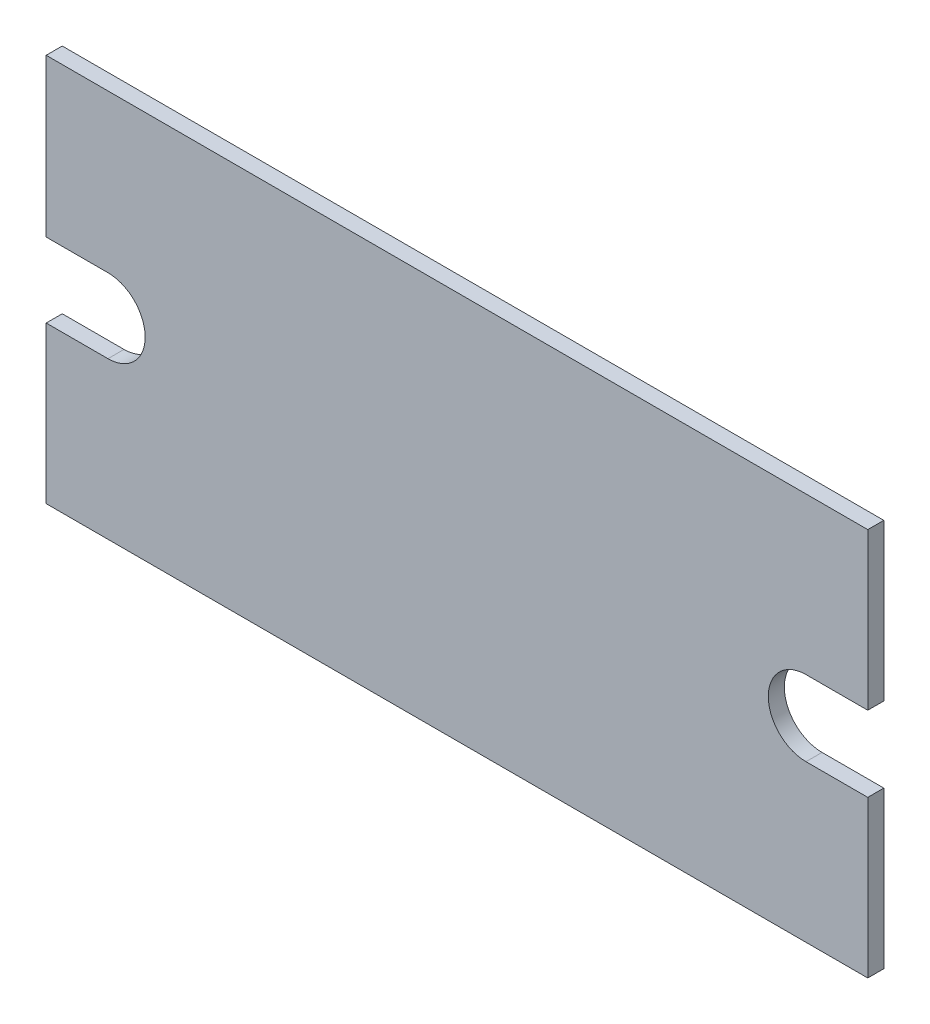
ISO-10303-21;
HEADER;
FILE_DESCRIPTION(('STEP AP214'),'2;1');
FILE_NAME('part.step','',(''),(''),'','','');
FILE_SCHEMA(('AUTOMOTIVE_DESIGN { 1 0 10303 214 1 1 1 1 }'));
ENDSEC;
DATA;
#1=APPLICATION_CONTEXT('core data for automotive mechanical design processes');
#2=APPLICATION_PROTOCOL_DEFINITION('international standard','automotive_design',2000,#1);
#3=PRODUCT_CONTEXT('',#1,'mechanical');
#4=PRODUCT('Part','Part','',(#3));
#5=PRODUCT_RELATED_PRODUCT_CATEGORY('part','',(#4));
#6=PRODUCT_DEFINITION_FORMATION('','',#4);
#7=PRODUCT_DEFINITION_CONTEXT('part definition',#1,'design');
#8=PRODUCT_DEFINITION('design','',#6,#7);
#9=PRODUCT_DEFINITION_SHAPE('','',#8);
#10=(LENGTH_UNIT() NAMED_UNIT(*) SI_UNIT(.MILLI.,.METRE.));
#11=(NAMED_UNIT(*) PLANE_ANGLE_UNIT() SI_UNIT($,.RADIAN.));
#12=(NAMED_UNIT(*) SI_UNIT($,.STERADIAN.) SOLID_ANGLE_UNIT());
#13=UNCERTAINTY_MEASURE_WITH_UNIT(LENGTH_MEASURE(1.E-05),#10,'distance_accuracy_value','');
#14=(GEOMETRIC_REPRESENTATION_CONTEXT(3) GLOBAL_UNCERTAINTY_ASSIGNED_CONTEXT((#13)) GLOBAL_UNIT_ASSIGNED_CONTEXT((#10,
#11,#12)) REPRESENTATION_CONTEXT('',''));
#15=CARTESIAN_POINT('',(0.,0.,0.));
#16=DIRECTION('',(0.,0.,1.));
#17=DIRECTION('',(1.,0.,0.));
#18=AXIS2_PLACEMENT_3D('',#15,#16,#17);
#19=CARTESIAN_POINT('',(-27.267227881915,0.335772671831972,1.));
#20=DIRECTION('',(1.,0.,0.));
#21=DIRECTION('',(0.,1.,0.));
#22=AXIS2_PLACEMENT_3D('',#19,#20,#21);
#23=PLANE('',#22);
#24=DIRECTION('',(0.,-1.,0.));
#25=VECTOR('',#24,1.);
#26=CARTESIAN_POINT('',(-27.267227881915,0.335772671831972,0.));
#27=LINE('',#26,#25);
#28=CARTESIAN_POINT('',(-27.267227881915,10.1470554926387,0.));
#29=VERTEX_POINT('',#28);
#30=CARTESIAN_POINT('',(-27.267227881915,0.335772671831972,0.));
#31=VERTEX_POINT('',#30);
#32=EDGE_CURVE('E160',#29,#31,#27,.T.);
#33=ORIENTED_EDGE('',*,*,#32,.T.);
#34=DIRECTION('',(0.,0.,-1.));
#35=VECTOR('',#34,1.);
#36=CARTESIAN_POINT('',(-27.267227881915,0.335772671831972,1.));
#37=LINE('',#36,#35);
#38=CARTESIAN_POINT('',(-27.267227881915,0.335772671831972,1.));
#39=VERTEX_POINT('',#38);
#40=EDGE_CURVE('E44',#39,#31,#37,.T.);
#41=ORIENTED_EDGE('',*,*,#40,.F.);
#42=DIRECTION('',(0.,-1.,0.));
#43=VECTOR('',#42,1.);
#44=CARTESIAN_POINT('',(-27.267227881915,10.085772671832,1.));
#45=LINE('',#44,#43);
#46=CARTESIAN_POINT('',(-27.267227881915,10.1470554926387,1.));
#47=VERTEX_POINT('',#46);
#48=EDGE_CURVE('E108',#47,#39,#45,.T.);
#49=ORIENTED_EDGE('',*,*,#48,.F.);
#50=DIRECTION('',(0.,0.,-1.));
#51=VECTOR('',#50,1.);
#52=CARTESIAN_POINT('',(-27.267227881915,10.1470554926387,1.));
#53=LINE('',#52,#51);
#54=EDGE_CURVE('E11',#47,#29,#53,.T.);
#55=ORIENTED_EDGE('',*,*,#54,.T.);
#56=EDGE_LOOP('',(#33,#41,#49,#55));
#57=FACE_BOUND('',#56,.T.);
#58=ADVANCED_FACE('F36',(#57),#23,.F.);
#59=CARTESIAN_POINT('',(-27.267227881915,0.335772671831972,1.));
#60=DIRECTION('',(0.,1.,0.));
#61=DIRECTION('',(0.,0.,1.));
#62=AXIS2_PLACEMENT_3D('',#59,#60,#61);
#63=PLANE('',#62);
#64=DIRECTION('',(1.,0.,0.));
#65=VECTOR('',#64,1.);
#66=CARTESIAN_POINT('',(-27.267227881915,0.335772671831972,0.));
#67=LINE('',#66,#65);
#68=CARTESIAN_POINT('',(-23.417227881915,0.335772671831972,0.));
#69=VERTEX_POINT('',#68);
#70=EDGE_CURVE('E162',#31,#69,#67,.T.);
#71=ORIENTED_EDGE('',*,*,#70,.T.);
#72=DIRECTION('',(0.,0.,-1.));
#73=VECTOR('',#72,1.);
#74=CARTESIAN_POINT('',(-23.417227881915,0.335772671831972,1.));
#75=LINE('',#74,#73);
#76=CARTESIAN_POINT('',(-23.417227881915,0.335772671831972,1.));
#77=VERTEX_POINT('',#76);
#78=EDGE_CURVE('E200',#77,#69,#75,.T.);
#79=ORIENTED_EDGE('',*,*,#78,.F.);
#80=DIRECTION('',(1.,0.,0.));
#81=VECTOR('',#80,1.);
#82=CARTESIAN_POINT('',(-27.267227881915,0.335772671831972,1.));
#83=LINE('',#82,#81);
#84=EDGE_CURVE('E208',#39,#77,#83,.T.);
#85=ORIENTED_EDGE('',*,*,#84,.F.);
#86=ORIENTED_EDGE('',*,*,#40,.T.);
#87=EDGE_LOOP('',(#71,#79,#85,#86));
#88=FACE_BOUND('',#87,.T.);
#89=ADVANCED_FACE('F206',(#88),#63,.F.);
#90=CARTESIAN_POINT('',(-23.417227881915,-1.98358591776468,1.));
#91=DIRECTION('',(0.,0.,-1.));
#92=DIRECTION('',(-1.,0.,0.));
#93=AXIS2_PLACEMENT_3D('',#90,#91,#92);
#94=CYLINDRICAL_SURFACE('',#93,2.31935858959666);
#95=CARTESIAN_POINT('',(-23.417227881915,-1.98358591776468,0.));
#96=DIRECTION('',(0.,0.,-1.));
#97=DIRECTION('',(-1.,0.,0.));
#98=AXIS2_PLACEMENT_3D('',#95,#96,#97);
#99=CIRCLE('',#98,2.31935858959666);
#100=CARTESIAN_POINT('',(-23.417227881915,-4.30294450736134,0.));
#101=VERTEX_POINT('',#100);
#102=EDGE_CURVE('E164',#69,#101,#99,.T.);
#103=ORIENTED_EDGE('',*,*,#102,.T.);
#104=DIRECTION('',(0.,0.,-1.));
#105=VECTOR('',#104,1.);
#106=CARTESIAN_POINT('',(-23.417227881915,-4.30294450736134,1.));
#107=LINE('',#106,#105);
#108=CARTESIAN_POINT('',(-23.417227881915,-4.30294450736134,1.));
#109=VERTEX_POINT('',#108);
#110=EDGE_CURVE('E197',#109,#101,#107,.T.);
#111=ORIENTED_EDGE('',*,*,#110,.F.);
#112=CARTESIAN_POINT('',(-23.417227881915,-1.98358591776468,1.));
#113=DIRECTION('',(0.,0.,-1.));
#114=DIRECTION('',(-1.,0.,0.));
#115=AXIS2_PLACEMENT_3D('',#112,#113,#114);
#116=CIRCLE('',#115,2.31935858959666);
#117=EDGE_CURVE('E226',#77,#109,#116,.T.);
#118=ORIENTED_EDGE('',*,*,#117,.F.);
#119=ORIENTED_EDGE('',*,*,#78,.T.);
#120=EDGE_LOOP('',(#103,#111,#118,#119));
#121=FACE_BOUND('',#120,.T.);
#122=ADVANCED_FACE('F217',(#121),#94,.F.);
#123=CARTESIAN_POINT('',(-27.267227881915,-4.30294450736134,1.));
#124=DIRECTION('',(0.,-1.,0.));
#125=DIRECTION('',(1.,0.,0.));
#126=AXIS2_PLACEMENT_3D('',#123,#124,#125);
#127=PLANE('',#126);
#128=DIRECTION('',(-1.,0.,0.));
#129=VECTOR('',#128,1.);
#130=CARTESIAN_POINT('',(-27.267227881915,-4.30294450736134,0.));
#131=LINE('',#130,#129);
#132=CARTESIAN_POINT('',(-27.267227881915,-4.30294450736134,0.));
#133=VERTEX_POINT('',#132);
#134=EDGE_CURVE('E166',#101,#133,#131,.T.);
#135=ORIENTED_EDGE('',*,*,#134,.T.);
#136=DIRECTION('',(0.,0.,-1.));
#137=VECTOR('',#136,1.);
#138=CARTESIAN_POINT('',(-27.267227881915,-4.30294450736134,1.));
#139=LINE('',#138,#137);
#140=CARTESIAN_POINT('',(-27.267227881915,-4.30294450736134,1.));
#141=VERTEX_POINT('',#140);
#142=EDGE_CURVE('E194',#141,#133,#139,.T.);
#143=ORIENTED_EDGE('',*,*,#142,.F.);
#144=DIRECTION('',(-1.,0.,0.));
#145=VECTOR('',#144,1.);
#146=CARTESIAN_POINT('',(-27.267227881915,-4.30294450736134,1.));
#147=LINE('',#146,#145);
#148=EDGE_CURVE('E223',#109,#141,#147,.T.);
#149=ORIENTED_EDGE('',*,*,#148,.F.);
#150=ORIENTED_EDGE('',*,*,#110,.T.);
#151=EDGE_LOOP('',(#135,#143,#149,#150));
#152=FACE_BOUND('',#151,.T.);
#153=ADVANCED_FACE('F221',(#152),#127,.F.);
#154=CARTESIAN_POINT('',(-27.267227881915,-14.0529445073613,1.));
#155=DIRECTION('',(1.,0.,0.));
#156=DIRECTION('',(0.,0.,-1.));
#157=AXIS2_PLACEMENT_3D('',#154,#155,#156);
#158=PLANE('',#157);
#159=DIRECTION('',(0.,-1.,0.));
#160=VECTOR('',#159,1.);
#161=CARTESIAN_POINT('',(-27.267227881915,-14.0529445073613,0.));
#162=LINE('',#161,#160);
#163=CARTESIAN_POINT('',(-27.267227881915,-14.0529445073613,0.));
#164=VERTEX_POINT('',#163);
#165=EDGE_CURVE('E168',#133,#164,#162,.T.);
#166=ORIENTED_EDGE('',*,*,#165,.T.);
#167=DIRECTION('',(0.,0.,-1.));
#168=VECTOR('',#167,1.);
#169=CARTESIAN_POINT('',(-27.267227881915,-14.0529445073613,1.));
#170=LINE('',#169,#168);
#171=CARTESIAN_POINT('',(-27.267227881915,-14.0529445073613,1.));
#172=VERTEX_POINT('',#171);
#173=EDGE_CURVE('E191',#172,#164,#170,.T.);
#174=ORIENTED_EDGE('',*,*,#173,.F.);
#175=DIRECTION('',(0.,-1.,0.));
#176=VECTOR('',#175,1.);
#177=CARTESIAN_POINT('',(-27.267227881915,-14.0529445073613,1.));
#178=LINE('',#177,#176);
#179=EDGE_CURVE('E225',#141,#172,#178,.T.);
#180=ORIENTED_EDGE('',*,*,#179,.F.);
#181=ORIENTED_EDGE('',*,*,#142,.T.);
#182=EDGE_LOOP('',(#166,#174,#180,#181));
#183=FACE_BOUND('',#182,.T.);
#184=ADVANCED_FACE('F257',(#183),#158,.F.);
#185=CARTESIAN_POINT('',(23.932772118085,-14.0529445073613,1.));
#186=DIRECTION('',(0.,1.,0.));
#187=DIRECTION('',(-1.,0.,0.));
#188=AXIS2_PLACEMENT_3D('',#185,#186,#187);
#189=PLANE('',#188);
#190=DIRECTION('',(1.,0.,0.));
#191=VECTOR('',#190,1.);
#192=CARTESIAN_POINT('',(23.932772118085,-14.0529445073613,0.));
#193=LINE('',#192,#191);
#194=CARTESIAN_POINT('',(23.932772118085,-14.0529445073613,0.));
#195=VERTEX_POINT('',#194);
#196=EDGE_CURVE('E170',#164,#195,#193,.T.);
#197=ORIENTED_EDGE('',*,*,#196,.T.);
#198=DIRECTION('',(0.,0.,-1.));
#199=VECTOR('',#198,1.);
#200=CARTESIAN_POINT('',(23.932772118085,-14.0529445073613,1.));
#201=LINE('',#200,#199);
#202=CARTESIAN_POINT('',(23.932772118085,-14.0529445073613,1.));
#203=VERTEX_POINT('',#202);
#204=EDGE_CURVE('E188',#203,#195,#201,.T.);
#205=ORIENTED_EDGE('',*,*,#204,.F.);
#206=DIRECTION('',(1.,0.,0.));
#207=VECTOR('',#206,1.);
#208=CARTESIAN_POINT('',(23.932772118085,-14.0529445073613,1.));
#209=LINE('',#208,#207);
#210=EDGE_CURVE('E228',#172,#203,#209,.T.);
#211=ORIENTED_EDGE('',*,*,#210,.F.);
#212=ORIENTED_EDGE('',*,*,#173,.T.);
#213=EDGE_LOOP('',(#197,#205,#211,#212));
#214=FACE_BOUND('',#213,.T.);
#215=ADVANCED_FACE('F260',(#214),#189,.F.);
#216=CARTESIAN_POINT('',(23.932772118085,-4.30294450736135,1.));
#217=DIRECTION('',(-1.,0.,0.));
#218=DIRECTION('',(0.,-1.,0.));
#219=AXIS2_PLACEMENT_3D('',#216,#217,#218);
#220=PLANE('',#219);
#221=DIRECTION('',(0.,1.,0.));
#222=VECTOR('',#221,1.);
#223=CARTESIAN_POINT('',(23.932772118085,-4.30294450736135,0.));
#224=LINE('',#223,#222);
#225=CARTESIAN_POINT('',(23.932772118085,-4.30294450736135,0.));
#226=VERTEX_POINT('',#225);
#227=EDGE_CURVE('E172',#195,#226,#224,.T.);
#228=ORIENTED_EDGE('',*,*,#227,.T.);
#229=DIRECTION('',(0.,0.,-1.));
#230=VECTOR('',#229,1.);
#231=CARTESIAN_POINT('',(23.932772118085,-4.30294450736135,1.));
#232=LINE('',#231,#230);
#233=CARTESIAN_POINT('',(23.932772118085,-4.30294450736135,1.));
#234=VERTEX_POINT('',#233);
#235=EDGE_CURVE('E185',#234,#226,#232,.T.);
#236=ORIENTED_EDGE('',*,*,#235,.F.);
#237=DIRECTION('',(0.,1.,0.));
#238=VECTOR('',#237,1.);
#239=CARTESIAN_POINT('',(23.932772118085,-4.30294450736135,1.));
#240=LINE('',#239,#238);
#241=EDGE_CURVE('E234',#203,#234,#240,.T.);
#242=ORIENTED_EDGE('',*,*,#241,.F.);
#243=ORIENTED_EDGE('',*,*,#204,.T.);
#244=EDGE_LOOP('',(#228,#236,#242,#243));
#245=FACE_BOUND('',#244,.T.);
#246=ADVANCED_FACE('F240',(#245),#220,.F.);
#247=CARTESIAN_POINT('',(23.932772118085,-4.30294450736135,1.));
#248=DIRECTION('',(0.,-1.,0.));
#249=DIRECTION('',(1.,0.,0.));
#250=AXIS2_PLACEMENT_3D('',#247,#248,#249);
#251=PLANE('',#250);
#252=DIRECTION('',(-1.,0.,0.));
#253=VECTOR('',#252,1.);
#254=CARTESIAN_POINT('',(23.932772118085,-4.30294450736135,0.));
#255=LINE('',#254,#253);
#256=CARTESIAN_POINT('',(20.082772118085,-4.30294450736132,0.));
#257=VERTEX_POINT('',#256);
#258=EDGE_CURVE('E174',#226,#257,#255,.T.);
#259=ORIENTED_EDGE('',*,*,#258,.T.);
#260=DIRECTION('',(0.,0.,-1.));
#261=VECTOR('',#260,1.);
#262=CARTESIAN_POINT('',(20.082772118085,-4.30294450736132,1.));
#263=LINE('',#262,#261);
#264=CARTESIAN_POINT('',(20.082772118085,-4.30294450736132,1.));
#265=VERTEX_POINT('',#264);
#266=EDGE_CURVE('E149',#265,#257,#263,.T.);
#267=ORIENTED_EDGE('',*,*,#266,.F.);
#268=DIRECTION('',(-1.,0.,0.));
#269=VECTOR('',#268,1.);
#270=CARTESIAN_POINT('',(23.932772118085,-4.30294450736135,1.));
#271=LINE('',#270,#269);
#272=EDGE_CURVE('E140',#234,#265,#271,.T.);
#273=ORIENTED_EDGE('',*,*,#272,.F.);
#274=ORIENTED_EDGE('',*,*,#235,.T.);
#275=EDGE_LOOP('',(#259,#267,#273,#274));
#276=FACE_BOUND('',#275,.T.);
#277=ADVANCED_FACE('F244',(#276),#251,.F.);
#278=CARTESIAN_POINT('',(20.082772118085,-1.95294450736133,1.));
#279=DIRECTION('',(0.,0.,-1.));
#280=DIRECTION('',(-1.,0.,0.));
#281=AXIS2_PLACEMENT_3D('',#278,#279,#280);
#282=CYLINDRICAL_SURFACE('',#281,2.34999999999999);
#283=CARTESIAN_POINT('',(20.082772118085,-1.95294450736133,0.));
#284=DIRECTION('',(0.,0.,-1.));
#285=DIRECTION('',(1.,0.,0.));
#286=AXIS2_PLACEMENT_3D('',#283,#284,#285);
#287=CIRCLE('',#286,2.34999999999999);
#288=CARTESIAN_POINT('',(20.082772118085,0.397055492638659,0.));
#289=VERTEX_POINT('',#288);
#290=EDGE_CURVE('E148',#257,#289,#287,.T.);
#291=ORIENTED_EDGE('',*,*,#290,.T.);
#292=DIRECTION('',(0.,0.,-1.));
#293=VECTOR('',#292,1.);
#294=CARTESIAN_POINT('',(20.082772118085,0.397055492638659,1.));
#295=LINE('',#294,#293);
#296=CARTESIAN_POINT('',(20.082772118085,0.397055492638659,1.));
#297=VERTEX_POINT('',#296);
#298=EDGE_CURVE('E145',#297,#289,#295,.T.);
#299=ORIENTED_EDGE('',*,*,#298,.F.);
#300=CARTESIAN_POINT('',(20.082772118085,-1.95294450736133,1.));
#301=DIRECTION('',(0.,0.,-1.));
#302=DIRECTION('',(1.,0.,0.));
#303=AXIS2_PLACEMENT_3D('',#300,#301,#302);
#304=CIRCLE('',#303,2.34999999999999);
#305=EDGE_CURVE('E134',#265,#297,#304,.T.);
#306=ORIENTED_EDGE('',*,*,#305,.F.);
#307=ORIENTED_EDGE('',*,*,#266,.T.);
#308=EDGE_LOOP('',(#291,#299,#306,#307));
#309=FACE_BOUND('',#308,.T.);
#310=ADVANCED_FACE('F146',(#309),#282,.F.);
#311=CARTESIAN_POINT('',(23.932772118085,0.397055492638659,1.));
#312=DIRECTION('',(0.,1.,0.));
#313=DIRECTION('',(-1.,0.,0.));
#314=AXIS2_PLACEMENT_3D('',#311,#312,#313);
#315=PLANE('',#314);
#316=DIRECTION('',(1.,0.,0.));
#317=VECTOR('',#316,1.);
#318=CARTESIAN_POINT('',(23.932772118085,0.397055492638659,0.));
#319=LINE('',#318,#317);
#320=CARTESIAN_POINT('',(23.932772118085,0.397055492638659,0.));
#321=VERTEX_POINT('',#320);
#322=EDGE_CURVE('E94',#289,#321,#319,.T.);
#323=ORIENTED_EDGE('',*,*,#322,.T.);
#324=DIRECTION('',(0.,0.,-1.));
#325=VECTOR('',#324,1.);
#326=CARTESIAN_POINT('',(23.932772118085,0.397055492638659,1.));
#327=LINE('',#326,#325);
#328=CARTESIAN_POINT('',(23.932772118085,0.397055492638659,1.));
#329=VERTEX_POINT('',#328);
#330=EDGE_CURVE('E150',#329,#321,#327,.T.);
#331=ORIENTED_EDGE('',*,*,#330,.F.);
#332=DIRECTION('',(1.,0.,0.));
#333=VECTOR('',#332,1.);
#334=CARTESIAN_POINT('',(23.932772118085,0.397055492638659,1.));
#335=LINE('',#334,#333);
#336=EDGE_CURVE('E138',#297,#329,#335,.T.);
#337=ORIENTED_EDGE('',*,*,#336,.F.);
#338=ORIENTED_EDGE('',*,*,#298,.T.);
#339=EDGE_LOOP('',(#323,#331,#337,#338));
#340=FACE_BOUND('',#339,.T.);
#341=ADVANCED_FACE('F152',(#340),#315,.F.);
#342=CARTESIAN_POINT('',(23.932772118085,10.1470554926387,1.));
#343=DIRECTION('',(-1.,0.,0.));
#344=DIRECTION('',(0.,0.,1.));
#345=AXIS2_PLACEMENT_3D('',#342,#343,#344);
#346=PLANE('',#345);
#347=DIRECTION('',(0.,1.,0.));
#348=VECTOR('',#347,1.);
#349=CARTESIAN_POINT('',(23.932772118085,10.1470554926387,0.));
#350=LINE('',#349,#348);
#351=CARTESIAN_POINT('',(23.932772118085,10.1470554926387,0.));
#352=VERTEX_POINT('',#351);
#353=EDGE_CURVE('E101',#321,#352,#350,.T.);
#354=ORIENTED_EDGE('',*,*,#353,.T.);
#355=DIRECTION('',(0.,0.,-1.));
#356=VECTOR('',#355,1.);
#357=CARTESIAN_POINT('',(23.932772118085,10.1470554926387,1.));
#358=LINE('',#357,#356);
#359=CARTESIAN_POINT('',(23.932772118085,10.1470554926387,1.));
#360=VERTEX_POINT('',#359);
#361=EDGE_CURVE('E156',#360,#352,#358,.T.);
#362=ORIENTED_EDGE('',*,*,#361,.F.);
#363=DIRECTION('',(0.,1.,0.));
#364=VECTOR('',#363,1.);
#365=CARTESIAN_POINT('',(23.932772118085,10.1470554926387,1.));
#366=LINE('',#365,#364);
#367=EDGE_CURVE('E154',#329,#360,#366,.T.);
#368=ORIENTED_EDGE('',*,*,#367,.F.);
#369=ORIENTED_EDGE('',*,*,#330,.T.);
#370=EDGE_LOOP('',(#354,#362,#368,#369));
#371=FACE_BOUND('',#370,.T.);
#372=ADVANCED_FACE('F273',(#371),#346,.F.);
#373=CARTESIAN_POINT('',(-17.4944671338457,10.1470554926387,1.));
#374=DIRECTION('',(0.,-1.,0.));
#375=DIRECTION('',(1.,0.,0.));
#376=AXIS2_PLACEMENT_3D('',#373,#374,#375);
#377=PLANE('',#376);
#378=DIRECTION('',(-1.,0.,0.));
#379=VECTOR('',#378,1.);
#380=CARTESIAN_POINT('',(-17.4944671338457,10.1470554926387,0.));
#381=LINE('',#380,#379);
#382=EDGE_CURVE('E179',#352,#29,#381,.T.);
#383=ORIENTED_EDGE('',*,*,#382,.T.);
#384=ORIENTED_EDGE('',*,*,#54,.F.);
#385=DIRECTION('',(-1.,0.,0.));
#386=VECTOR('',#385,1.);
#387=CARTESIAN_POINT('',(-17.4944671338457,10.1470554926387,1.));
#388=LINE('',#387,#386);
#389=EDGE_CURVE('E52',#360,#47,#388,.T.);
#390=ORIENTED_EDGE('',*,*,#389,.F.);
#391=ORIENTED_EDGE('',*,*,#361,.T.);
#392=EDGE_LOOP('',(#383,#384,#390,#391));
#393=FACE_BOUND('',#392,.T.);
#394=ADVANCED_FACE('F245',(#393),#377,.F.);
#395=CARTESIAN_POINT('',(-23.417227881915,-1.98358591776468,1.));
#396=DIRECTION('',(0.,0.,-1.));
#397=DIRECTION('',(-1.,0.,0.));
#398=AXIS2_PLACEMENT_3D('',#395,#396,#397);
#399=PLANE('',#398);
#400=ORIENTED_EDGE('',*,*,#389,.T.);
#401=ORIENTED_EDGE('',*,*,#48,.T.);
#402=ORIENTED_EDGE('',*,*,#84,.T.);
#403=ORIENTED_EDGE('',*,*,#117,.T.);
#404=ORIENTED_EDGE('',*,*,#148,.T.);
#405=ORIENTED_EDGE('',*,*,#179,.T.);
#406=ORIENTED_EDGE('',*,*,#210,.T.);
#407=ORIENTED_EDGE('',*,*,#241,.T.);
#408=ORIENTED_EDGE('',*,*,#272,.T.);
#409=ORIENTED_EDGE('',*,*,#305,.T.);
#410=ORIENTED_EDGE('',*,*,#336,.T.);
#411=ORIENTED_EDGE('',*,*,#367,.T.);
#412=EDGE_LOOP('',(#400,#401,#402,#403,#404,#405,#406,#407,#408,#409,#410,#411));
#413=FACE_BOUND('',#412,.T.);
#414=ADVANCED_FACE('F136',(#413),#399,.F.);
#415=CARTESIAN_POINT('',(-23.417227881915,-1.98358591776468,0.));
#416=DIRECTION('',(0.,0.,-1.));
#417=DIRECTION('',(-1.,0.,0.));
#418=AXIS2_PLACEMENT_3D('',#415,#416,#417);
#419=PLANE('',#418);
#420=ORIENTED_EDGE('',*,*,#32,.F.);
#421=ORIENTED_EDGE('',*,*,#382,.F.);
#422=ORIENTED_EDGE('',*,*,#353,.F.);
#423=ORIENTED_EDGE('',*,*,#322,.F.);
#424=ORIENTED_EDGE('',*,*,#290,.F.);
#425=ORIENTED_EDGE('',*,*,#258,.F.);
#426=ORIENTED_EDGE('',*,*,#227,.F.);
#427=ORIENTED_EDGE('',*,*,#196,.F.);
#428=ORIENTED_EDGE('',*,*,#165,.F.);
#429=ORIENTED_EDGE('',*,*,#134,.F.);
#430=ORIENTED_EDGE('',*,*,#102,.F.);
#431=ORIENTED_EDGE('',*,*,#70,.F.);
#432=EDGE_LOOP('',(#420,#421,#422,#423,#424,#425,#426,#427,#428,#429,#430,#431));
#433=FACE_BOUND('',#432,.T.);
#434=ADVANCED_FACE('F211',(#433),#419,.T.);
#435=CLOSED_SHELL('',(#58,#89,#122,#153,#184,#215,#246,#277,#310,#341,#372,#394,#414,#434));
#436=MANIFOLD_SOLID_BREP('B2',#435);
#437=ADVANCED_BREP_SHAPE_REPRESENTATION('',(#18,#436),#14);
#438=SHAPE_DEFINITION_REPRESENTATION(#9,#437);
ENDSEC;
END-ISO-10303-21;
